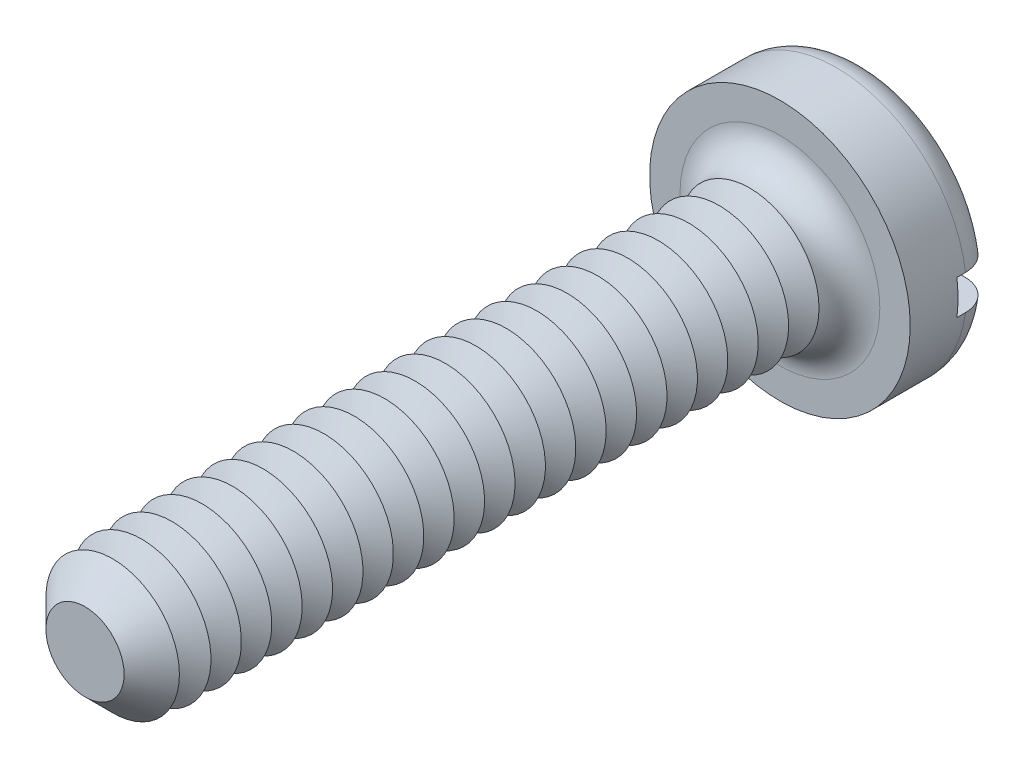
from build123d import *

# Parameters (mm, degrees)
SKETCH3_R           = 1.5
BOSS_EXTRUDE2_DEPTH = 1
SKETCH4_R           = 0.8
BOSS_EXTRUDE3_DEPTH = 8
FILLET1_R           = 0.35
CHAMFER1_SIZE       = 0.35
LPATTERN1_COUNT     = 21
LPATTERN1_PITCH     = 0.35
SKETCH8_W           = 3
SKETCH8_H           = 0.4
CUT_EXTRUDE1_DEPTH  = 0.45


with BuildPart() as part:
    # Sketch3 → Boss-Extrude2 (new body)
    with BuildSketch(Plane.XY):
        Circle(SKETCH3_R)
    extrude(amount=-BOSS_EXTRUDE2_DEPTH)

    # Sketch4 → Boss-Extrude3 (add)
    with BuildSketch(Plane.XY):
        Circle(SKETCH4_R)
    extrude(amount=BOSS_EXTRUDE3_DEPTH)

    # Fillet1
    fillet1_edges = [part.edges().sort_by_distance(p)[0] for p in [
        (-1.5, 0, -1),
        (-0.8, 0, 0),
    ]]
    fillet(fillet1_edges, radius=FILLET1_R)

    # Chamfer1
    chamfer1_edges = [part.edges().sort_by_distance(p)[0] for p in [
        (-0.8, 0, 8),
    ]]
    chamfer(chamfer1_edges, length=CHAMFER1_SIZE)

    # Sketch6 → Cut-Revolve1 (revolve, cut)
    with BuildSketch(Plane(origin=(0, 0, 0), x_dir=(0, 0, -1), z_dir=(1, 0, 0)), mode=Mode.PRIVATE) as cut_revolve1_sk:
        Polygon((-0.35, 0.8), (-0.525, 0.496891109), (-0.7, 0.8), align=None)
    cut_revolve1 = revolve(cut_revolve1_sk.sketch.rotate(Axis((0, 0, -1.694361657), (0, 0, 1)), 90), axis=Axis((0, 0, -1.694361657), (0, 0, 1)), mode=Mode.SUBTRACT)

    # LPattern1: Cut-Revolve1 ×21
    with Locations(*[(0, 0, i * LPATTERN1_PITCH) for i in range(1, LPATTERN1_COUNT)]):
        add(cut_revolve1, mode=Mode.SUBTRACT)

    # Sketch8 → Cut-Extrude1 (cut)
    with BuildSketch(Plane(origin=(0, 0, -1), x_dir=(-1, 0, 0), z_dir=(0, 0, -1))):
        Rectangle(SKETCH8_W, SKETCH8_H)
    extrude(amount=-CUT_EXTRUDE1_DEPTH, mode=Mode.SUBTRACT)


solid = part.part
